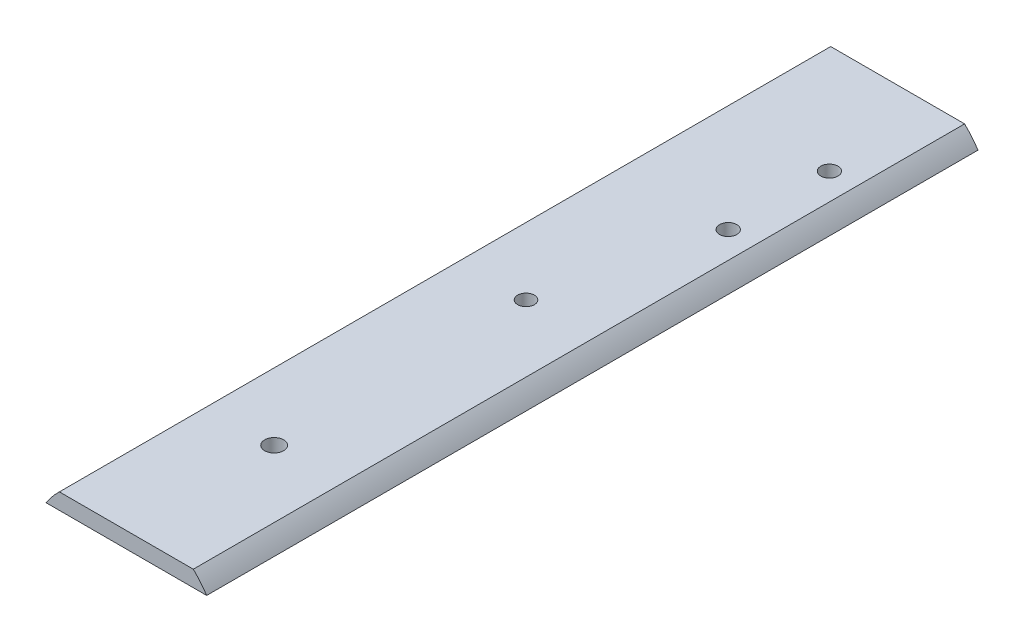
ISO-10303-21;
HEADER;
FILE_DESCRIPTION(('STEP AP214'),'2;1');
FILE_NAME('part.step','',(''),(''),'','','');
FILE_SCHEMA(('AUTOMOTIVE_DESIGN { 1 0 10303 214 1 1 1 1 }'));
ENDSEC;
DATA;
#1=APPLICATION_CONTEXT('core data for automotive mechanical design processes');
#2=APPLICATION_PROTOCOL_DEFINITION('international standard','automotive_design',2000,#1);
#3=PRODUCT_CONTEXT('',#1,'mechanical');
#4=PRODUCT('Part','Part','',(#3));
#5=PRODUCT_RELATED_PRODUCT_CATEGORY('part','',(#4));
#6=PRODUCT_DEFINITION_FORMATION('','',#4);
#7=PRODUCT_DEFINITION_CONTEXT('part definition',#1,'design');
#8=PRODUCT_DEFINITION('design','',#6,#7);
#9=PRODUCT_DEFINITION_SHAPE('','',#8);
#10=(LENGTH_UNIT() NAMED_UNIT(*) SI_UNIT(.MILLI.,.METRE.));
#11=(NAMED_UNIT(*) PLANE_ANGLE_UNIT() SI_UNIT($,.RADIAN.));
#12=(NAMED_UNIT(*) SI_UNIT($,.STERADIAN.) SOLID_ANGLE_UNIT());
#13=UNCERTAINTY_MEASURE_WITH_UNIT(LENGTH_MEASURE(1.E-05),#10,'distance_accuracy_value','');
#14=(GEOMETRIC_REPRESENTATION_CONTEXT(3) GLOBAL_UNCERTAINTY_ASSIGNED_CONTEXT((#13)) GLOBAL_UNIT_ASSIGNED_CONTEXT((#10,
#11,#12)) REPRESENTATION_CONTEXT('',''));
#15=CARTESIAN_POINT('',(0.,0.,0.));
#16=DIRECTION('',(0.,0.,1.));
#17=DIRECTION('',(1.,0.,0.));
#18=AXIS2_PLACEMENT_3D('',#15,#16,#17);
#19=CARTESIAN_POINT('',(-8.01603840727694,-13.3079166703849,54.0229522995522));
#20=DIRECTION('',(0.,0.,-1.));
#21=DIRECTION('',(-1.,0.,0.));
#22=AXIS2_PLACEMENT_3D('',#19,#20,#21);
#23=CYLINDRICAL_SURFACE('',#22,19.05);
#24=CARTESIAN_POINT('',(-8.01603840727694,-13.3079166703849,54.0229522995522));
#25=DIRECTION('',(0.,0.,1.));
#26=DIRECTION('',(1.,0.,0.));
#27=AXIS2_PLACEMENT_3D('',#24,#25,#26);
#28=CIRCLE('',#27,19.05);
#29=CARTESIAN_POINT('',(7.85896159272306,-2.77763296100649,54.0229522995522));
#30=VERTEX_POINT('',#29);
#31=CARTESIAN_POINT('',(5.21527666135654,0.397367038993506,54.0229522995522));
#32=VERTEX_POINT('',#31);
#33=EDGE_CURVE('E38',#30,#32,#28,.T.);
#34=ORIENTED_EDGE('',*,*,#33,.F.);
#35=DIRECTION('',(0.,0.,1.));
#36=VECTOR('',#35,1.);
#37=CARTESIAN_POINT('',(7.85896159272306,-2.77763296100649,-98.3770477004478));
#38=LINE('',#37,#36);
#39=CARTESIAN_POINT('',(7.85896159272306,-2.77763296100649,-98.3770477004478));
#40=VERTEX_POINT('',#39);
#41=EDGE_CURVE('E70',#40,#30,#38,.T.);
#42=ORIENTED_EDGE('',*,*,#41,.F.);
#43=CARTESIAN_POINT('',(-8.01603840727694,-13.3079166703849,-98.3770477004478));
#44=DIRECTION('',(0.,0.,1.));
#45=DIRECTION('',(1.,0.,0.));
#46=AXIS2_PLACEMENT_3D('',#43,#44,#45);
#47=CIRCLE('',#46,19.05);
#48=CARTESIAN_POINT('',(5.21527666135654,0.397367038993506,-98.3770477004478));
#49=VERTEX_POINT('',#48);
#50=EDGE_CURVE('E53',#40,#49,#47,.T.);
#51=ORIENTED_EDGE('',*,*,#50,.T.);
#52=DIRECTION('',(0.,0.,1.));
#53=VECTOR('',#52,1.);
#54=CARTESIAN_POINT('',(5.21527666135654,0.397367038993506,-98.3770477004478));
#55=LINE('',#54,#53);
#56=EDGE_CURVE('E84',#49,#32,#55,.T.);
#57=ORIENTED_EDGE('',*,*,#56,.T.);
#58=EDGE_LOOP('',(#34,#42,#51,#57));
#59=FACE_BOUND('',#58,.T.);
#60=ADVANCED_FACE('F30',(#59),#23,.T.);
#61=CARTESIAN_POINT('',(-21.2473534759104,0.397367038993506,-98.3770477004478));
#62=VERTEX_POINT('',#61);
#63=CARTESIAN_POINT('',(-23.8910384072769,-2.77763296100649,-98.3770477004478));
#64=VERTEX_POINT('',#63);
#65=EDGE_CURVE('E85',#62,#64,#47,.T.);
#66=ORIENTED_EDGE('',*,*,#65,.T.);
#67=DIRECTION('',(0.,0.,1.));
#68=VECTOR('',#67,1.);
#69=CARTESIAN_POINT('',(-23.8910384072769,-2.77763296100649,-98.3770477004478));
#70=LINE('',#69,#68);
#71=CARTESIAN_POINT('',(-23.8910384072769,-2.77763296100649,54.0229522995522));
#72=VERTEX_POINT('',#71);
#73=EDGE_CURVE('E45',#64,#72,#70,.T.);
#74=ORIENTED_EDGE('',*,*,#73,.T.);
#75=CARTESIAN_POINT('',(-21.2473534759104,0.397367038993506,54.0229522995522));
#76=VERTEX_POINT('',#75);
#77=EDGE_CURVE('E11',#76,#72,#28,.T.);
#78=ORIENTED_EDGE('',*,*,#77,.F.);
#79=DIRECTION('',(0.,0.,1.));
#80=VECTOR('',#79,1.);
#81=CARTESIAN_POINT('',(-21.2473534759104,0.397367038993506,-98.3770477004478));
#82=LINE('',#81,#80);
#83=EDGE_CURVE('E91',#62,#76,#82,.T.);
#84=ORIENTED_EDGE('',*,*,#83,.F.);
#85=EDGE_LOOP('',(#66,#74,#78,#84));
#86=FACE_BOUND('',#85,.T.);
#87=ADVANCED_FACE('F32',(#86),#23,.T.);
#88=CARTESIAN_POINT('',(-8.01603840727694,-13.3079166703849,54.0229522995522));
#89=DIRECTION('',(0.,0.,1.));
#90=DIRECTION('',(1.,0.,0.));
#91=AXIS2_PLACEMENT_3D('',#88,#89,#90);
#92=PLANE('',#91);
#93=DIRECTION('',(-1.,0.,0.));
#94=VECTOR('',#93,1.);
#95=CARTESIAN_POINT('',(-23.8910384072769,-2.77763296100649,54.0229522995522));
#96=LINE('',#95,#94);
#97=EDGE_CURVE('E73',#30,#72,#96,.T.);
#98=ORIENTED_EDGE('',*,*,#97,.F.);
#99=ORIENTED_EDGE('',*,*,#33,.T.);
#100=DIRECTION('',(1.,0.,0.));
#101=VECTOR('',#100,1.);
#102=CARTESIAN_POINT('',(-21.2473534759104,0.397367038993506,54.0229522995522));
#103=LINE('',#102,#101);
#104=EDGE_CURVE('E97',#76,#32,#103,.T.);
#105=ORIENTED_EDGE('',*,*,#104,.F.);
#106=ORIENTED_EDGE('',*,*,#77,.T.);
#107=EDGE_LOOP('',(#98,#99,#105,#106));
#108=FACE_BOUND('',#107,.T.);
#109=ADVANCED_FACE('F78',(#108),#92,.T.);
#110=CARTESIAN_POINT('',(-8.01603840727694,-13.3079166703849,-98.3770477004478));
#111=DIRECTION('',(0.,0.,1.));
#112=DIRECTION('',(1.,0.,0.));
#113=AXIS2_PLACEMENT_3D('',#110,#111,#112);
#114=PLANE('',#113);
#115=ORIENTED_EDGE('',*,*,#50,.F.);
#116=DIRECTION('',(-1.,0.,0.));
#117=VECTOR('',#116,1.);
#118=CARTESIAN_POINT('',(-23.8910384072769,-2.77763296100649,-98.3770477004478));
#119=LINE('',#118,#117);
#120=EDGE_CURVE('E74',#40,#64,#119,.T.);
#121=ORIENTED_EDGE('',*,*,#120,.T.);
#122=ORIENTED_EDGE('',*,*,#65,.F.);
#123=DIRECTION('',(1.,0.,0.));
#124=VECTOR('',#123,1.);
#125=CARTESIAN_POINT('',(-21.2473534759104,0.397367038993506,-98.3770477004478));
#126=LINE('',#125,#124);
#127=EDGE_CURVE('E93',#62,#49,#126,.T.);
#128=ORIENTED_EDGE('',*,*,#127,.T.);
#129=EDGE_LOOP('',(#115,#121,#122,#128));
#130=FACE_BOUND('',#129,.T.);
#131=ADVANCED_FACE('F156',(#130),#114,.F.);
#132=CARTESIAN_POINT('',(-21.2473534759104,0.397367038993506,-98.3770477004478));
#133=DIRECTION('',(0.,-1.,0.));
#134=DIRECTION('',(0.,0.,-1.));
#135=AXIS2_PLACEMENT_3D('',#132,#133,#134);
#136=PLANE('',#135);
#137=CARTESIAN_POINT('',(-7.99833368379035,0.397367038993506,24.8349642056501));
#138=DIRECTION('',(0.,-1.,0.));
#139=DIRECTION('',(0.,0.,-1.));
#140=AXIS2_PLACEMENT_3D('',#137,#138,#139);
#141=CIRCLE('',#140,1.87646706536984);
#142=CARTESIAN_POINT('',(-7.99833368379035,0.397367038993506,22.9584971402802));
#143=VERTEX_POINT('',#142);
#144=EDGE_CURVE('E118',#143,#143,#141,.T.);
#145=ORIENTED_EDGE('',*,*,#144,.T.);
#146=EDGE_LOOP('',(#145));
#147=FACE_BOUND('',#146,.T.);
#148=CARTESIAN_POINT('',(-7.99833368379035,0.397367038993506,-24.9257296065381));
#149=DIRECTION('',(0.,-1.,0.));
#150=DIRECTION('',(0.,0.,-1.));
#151=AXIS2_PLACEMENT_3D('',#148,#149,#150);
#152=CIRCLE('',#151,1.651);
#153=CARTESIAN_POINT('',(-7.99833368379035,0.397367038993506,-26.5767296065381));
#154=VERTEX_POINT('',#153);
#155=EDGE_CURVE('E112',#154,#154,#152,.T.);
#156=ORIENTED_EDGE('',*,*,#155,.T.);
#157=EDGE_LOOP('',(#156));
#158=FACE_BOUND('',#157,.T.);
#159=CARTESIAN_POINT('',(-0.0586039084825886,0.397367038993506,-56.9389326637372));
#160=DIRECTION('',(0.,-1.,0.));
#161=DIRECTION('',(0.,0.,-1.));
#162=AXIS2_PLACEMENT_3D('',#159,#160,#161);
#163=CIRCLE('',#162,1.69999999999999);
#164=CARTESIAN_POINT('',(-0.0586039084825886,0.397367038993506,-58.6389326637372));
#165=VERTEX_POINT('',#164);
#166=EDGE_CURVE('E106',#165,#165,#163,.T.);
#167=ORIENTED_EDGE('',*,*,#166,.T.);
#168=EDGE_LOOP('',(#167));
#169=FACE_BOUND('',#168,.T.);
#170=CARTESIAN_POINT('',(-0.0586039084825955,0.397367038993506,-76.9389326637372));
#171=DIRECTION('',(0.,-1.,0.));
#172=DIRECTION('',(0.,0.,-1.));
#173=AXIS2_PLACEMENT_3D('',#170,#171,#172);
#174=CIRCLE('',#173,1.69999999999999);
#175=CARTESIAN_POINT('',(-0.0586039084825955,0.397367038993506,-78.6389326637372));
#176=VERTEX_POINT('',#175);
#177=EDGE_CURVE('E82',#176,#176,#174,.T.);
#178=ORIENTED_EDGE('',*,*,#177,.T.);
#179=EDGE_LOOP('',(#178));
#180=FACE_BOUND('',#179,.T.);
#181=ORIENTED_EDGE('',*,*,#104,.T.);
#182=ORIENTED_EDGE('',*,*,#56,.F.);
#183=ORIENTED_EDGE('',*,*,#127,.F.);
#184=ORIENTED_EDGE('',*,*,#83,.T.);
#185=EDGE_LOOP('',(#181,#182,#183,#184));
#186=FACE_BOUND('',#185,.T.);
#187=ADVANCED_FACE('F130',(#147,#158,#169,#180,#186),#136,.F.);
#188=CARTESIAN_POINT('',(-23.8910384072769,-2.77763296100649,-98.3770477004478));
#189=DIRECTION('',(0.,1.,0.));
#190=DIRECTION('',(0.,0.,1.));
#191=AXIS2_PLACEMENT_3D('',#188,#189,#190);
#192=PLANE('',#191);
#193=CARTESIAN_POINT('',(-7.99833368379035,-2.77763296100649,24.8349642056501));
#194=DIRECTION('',(0.,-1.,0.));
#195=DIRECTION('',(0.,0.,-1.));
#196=AXIS2_PLACEMENT_3D('',#193,#194,#195);
#197=CIRCLE('',#196,1.87646706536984);
#198=CARTESIAN_POINT('',(-7.99833368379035,-2.77763296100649,22.9584971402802));
#199=VERTEX_POINT('',#198);
#200=EDGE_CURVE('E121',#199,#199,#197,.T.);
#201=ORIENTED_EDGE('',*,*,#200,.F.);
#202=EDGE_LOOP('',(#201));
#203=FACE_BOUND('',#202,.T.);
#204=CARTESIAN_POINT('',(-7.99833368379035,-2.77763296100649,-24.9257296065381));
#205=DIRECTION('',(0.,-1.,0.));
#206=DIRECTION('',(0.,0.,-1.));
#207=AXIS2_PLACEMENT_3D('',#204,#205,#206);
#208=CIRCLE('',#207,1.651);
#209=CARTESIAN_POINT('',(-7.99833368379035,-2.77763296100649,-26.5767296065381));
#210=VERTEX_POINT('',#209);
#211=EDGE_CURVE('E115',#210,#210,#208,.T.);
#212=ORIENTED_EDGE('',*,*,#211,.F.);
#213=EDGE_LOOP('',(#212));
#214=FACE_BOUND('',#213,.T.);
#215=CARTESIAN_POINT('',(-0.0586039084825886,-2.77763296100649,-56.9389326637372));
#216=DIRECTION('',(0.,-1.,0.));
#217=DIRECTION('',(0.,0.,-1.));
#218=AXIS2_PLACEMENT_3D('',#215,#216,#217);
#219=CIRCLE('',#218,1.69999999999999);
#220=CARTESIAN_POINT('',(-0.0586039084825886,-2.77763296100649,-58.6389326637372));
#221=VERTEX_POINT('',#220);
#222=EDGE_CURVE('E109',#221,#221,#219,.T.);
#223=ORIENTED_EDGE('',*,*,#222,.F.);
#224=EDGE_LOOP('',(#223));
#225=FACE_BOUND('',#224,.T.);
#226=CARTESIAN_POINT('',(-0.0586039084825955,-2.77763296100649,-76.9389326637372));
#227=DIRECTION('',(0.,-1.,0.));
#228=DIRECTION('',(0.,0.,-1.));
#229=AXIS2_PLACEMENT_3D('',#226,#227,#228);
#230=CIRCLE('',#229,1.69999999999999);
#231=CARTESIAN_POINT('',(-0.0586039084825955,-2.77763296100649,-78.6389326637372));
#232=VERTEX_POINT('',#231);
#233=EDGE_CURVE('E103',#232,#232,#230,.T.);
#234=ORIENTED_EDGE('',*,*,#233,.F.);
#235=EDGE_LOOP('',(#234));
#236=FACE_BOUND('',#235,.T.);
#237=ORIENTED_EDGE('',*,*,#97,.T.);
#238=ORIENTED_EDGE('',*,*,#73,.F.);
#239=ORIENTED_EDGE('',*,*,#120,.F.);
#240=ORIENTED_EDGE('',*,*,#41,.T.);
#241=EDGE_LOOP('',(#237,#238,#239,#240));
#242=FACE_BOUND('',#241,.T.);
#243=ADVANCED_FACE('F72',(#203,#214,#225,#236,#242),#192,.F.);
#244=CARTESIAN_POINT('',(-0.0586039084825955,0.397367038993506,-76.9389326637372));
#245=DIRECTION('',(0.,-1.,0.));
#246=DIRECTION('',(0.,0.,-1.));
#247=AXIS2_PLACEMENT_3D('',#244,#245,#246);
#248=CYLINDRICAL_SURFACE('',#247,1.69999999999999);
#249=ORIENTED_EDGE('',*,*,#177,.F.);
#250=EDGE_LOOP('',(#249));
#251=FACE_BOUND('',#250,.T.);
#252=ORIENTED_EDGE('',*,*,#233,.T.);
#253=EDGE_LOOP('',(#252));
#254=FACE_BOUND('',#253,.T.);
#255=ADVANCED_FACE('F129',(#251,#254),#248,.F.);
#256=CARTESIAN_POINT('',(-0.0586039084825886,0.397367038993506,-56.9389326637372));
#257=DIRECTION('',(0.,-1.,0.));
#258=DIRECTION('',(0.,0.,-1.));
#259=AXIS2_PLACEMENT_3D('',#256,#257,#258);
#260=CYLINDRICAL_SURFACE('',#259,1.69999999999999);
#261=ORIENTED_EDGE('',*,*,#166,.F.);
#262=EDGE_LOOP('',(#261));
#263=FACE_BOUND('',#262,.T.);
#264=ORIENTED_EDGE('',*,*,#222,.T.);
#265=EDGE_LOOP('',(#264));
#266=FACE_BOUND('',#265,.T.);
#267=ADVANCED_FACE('F139',(#263,#266),#260,.F.);
#268=CARTESIAN_POINT('',(-7.99833368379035,0.397367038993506,-24.9257296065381));
#269=DIRECTION('',(0.,-1.,0.));
#270=DIRECTION('',(0.,0.,-1.));
#271=AXIS2_PLACEMENT_3D('',#268,#269,#270);
#272=CYLINDRICAL_SURFACE('',#271,1.651);
#273=ORIENTED_EDGE('',*,*,#155,.F.);
#274=EDGE_LOOP('',(#273));
#275=FACE_BOUND('',#274,.T.);
#276=ORIENTED_EDGE('',*,*,#211,.T.);
#277=EDGE_LOOP('',(#276));
#278=FACE_BOUND('',#277,.T.);
#279=ADVANCED_FACE('F145',(#275,#278),#272,.F.);
#280=CARTESIAN_POINT('',(-7.99833368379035,0.397367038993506,24.8349642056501));
#281=DIRECTION('',(0.,-1.,0.));
#282=DIRECTION('',(0.,0.,-1.));
#283=AXIS2_PLACEMENT_3D('',#280,#281,#282);
#284=CYLINDRICAL_SURFACE('',#283,1.87646706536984);
#285=ORIENTED_EDGE('',*,*,#144,.F.);
#286=EDGE_LOOP('',(#285));
#287=FACE_BOUND('',#286,.T.);
#288=ORIENTED_EDGE('',*,*,#200,.T.);
#289=EDGE_LOOP('',(#288));
#290=FACE_BOUND('',#289,.T.);
#291=ADVANCED_FACE('F125',(#287,#290),#284,.F.);
#292=CLOSED_SHELL('',(#60,#87,#109,#131,#187,#243,#255,#267,#279,#291));
#293=MANIFOLD_SOLID_BREP('B2',#292);
#294=ADVANCED_BREP_SHAPE_REPRESENTATION('',(#18,#293),#14);
#295=SHAPE_DEFINITION_REPRESENTATION(#9,#294);
ENDSEC;
END-ISO-10303-21;
